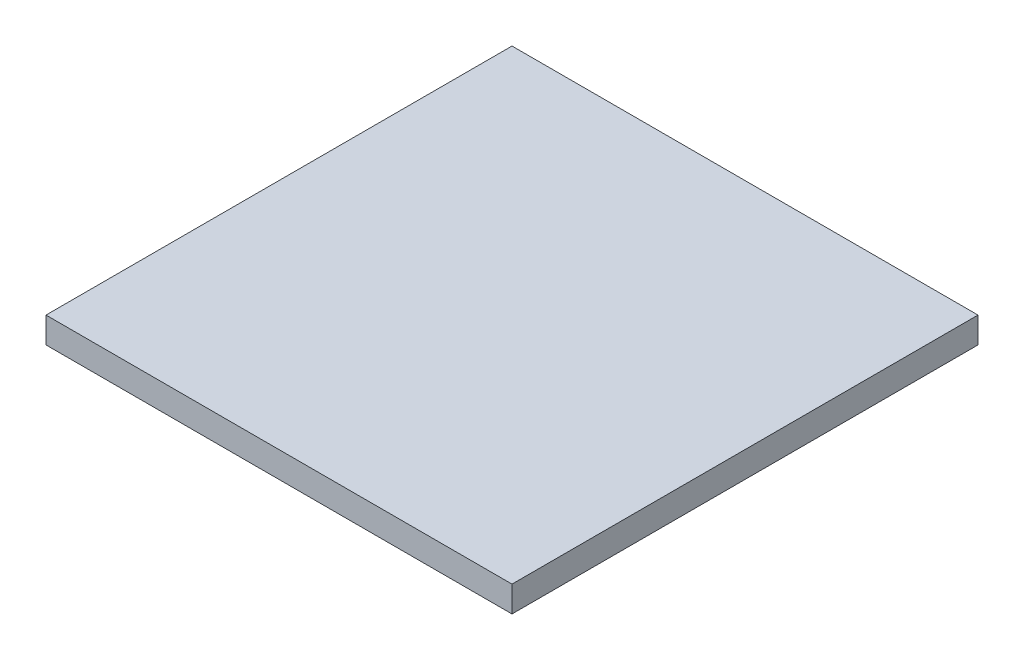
ISO-10303-21;
HEADER;
FILE_DESCRIPTION(('STEP AP214'),'2;1');
FILE_NAME('part.step','',(''),(''),'','','');
FILE_SCHEMA(('AUTOMOTIVE_DESIGN { 1 0 10303 214 1 1 1 1 }'));
ENDSEC;
DATA;
#1=APPLICATION_CONTEXT('core data for automotive mechanical design processes');
#2=APPLICATION_PROTOCOL_DEFINITION('international standard','automotive_design',2000,#1);
#3=PRODUCT_CONTEXT('',#1,'mechanical');
#4=PRODUCT('Part','Part','',(#3));
#5=PRODUCT_RELATED_PRODUCT_CATEGORY('part','',(#4));
#6=PRODUCT_DEFINITION_FORMATION('','',#4);
#7=PRODUCT_DEFINITION_CONTEXT('part definition',#1,'design');
#8=PRODUCT_DEFINITION('design','',#6,#7);
#9=PRODUCT_DEFINITION_SHAPE('','',#8);
#10=(LENGTH_UNIT() NAMED_UNIT(*) SI_UNIT(.MILLI.,.METRE.));
#11=(NAMED_UNIT(*) PLANE_ANGLE_UNIT() SI_UNIT($,.RADIAN.));
#12=(NAMED_UNIT(*) SI_UNIT($,.STERADIAN.) SOLID_ANGLE_UNIT());
#13=UNCERTAINTY_MEASURE_WITH_UNIT(LENGTH_MEASURE(1.E-05),#10,'distance_accuracy_value','');
#14=(GEOMETRIC_REPRESENTATION_CONTEXT(3) GLOBAL_UNCERTAINTY_ASSIGNED_CONTEXT((#13)) GLOBAL_UNIT_ASSIGNED_CONTEXT((#10,
#11,#12)) REPRESENTATION_CONTEXT('',''));
#15=CARTESIAN_POINT('',(0.,0.,0.));
#16=DIRECTION('',(0.,0.,1.));
#17=DIRECTION('',(1.,0.,0.));
#18=AXIS2_PLACEMENT_3D('',#15,#16,#17);
#19=CARTESIAN_POINT('',(-228.6,-25.4,228.6));
#20=DIRECTION('',(-1.,0.,0.));
#21=DIRECTION('',(0.,0.,1.));
#22=AXIS2_PLACEMENT_3D('',#19,#20,#21);
#23=PLANE('',#22);
#24=DIRECTION('',(0.,0.,1.));
#25=VECTOR('',#24,1.);
#26=CARTESIAN_POINT('',(-228.6,0.,228.6));
#27=LINE('',#26,#25);
#28=CARTESIAN_POINT('',(-228.6,0.,-228.6));
#29=VERTEX_POINT('',#28);
#30=CARTESIAN_POINT('',(-228.6,0.,228.6));
#31=VERTEX_POINT('',#30);
#32=EDGE_CURVE('E71',#29,#31,#27,.T.);
#33=ORIENTED_EDGE('',*,*,#32,.F.);
#34=DIRECTION('',(0.,1.,0.));
#35=VECTOR('',#34,1.);
#36=CARTESIAN_POINT('',(-228.6,-25.4,-228.6));
#37=LINE('',#36,#35);
#38=CARTESIAN_POINT('',(-228.6,-25.4,-228.6));
#39=VERTEX_POINT('',#38);
#40=EDGE_CURVE('E11',#39,#29,#37,.T.);
#41=ORIENTED_EDGE('',*,*,#40,.F.);
#42=DIRECTION('',(0.,0.,1.));
#43=VECTOR('',#42,1.);
#44=CARTESIAN_POINT('',(-228.6,-25.4,228.6));
#45=LINE('',#44,#43);
#46=CARTESIAN_POINT('',(-228.6,-25.4,228.6));
#47=VERTEX_POINT('',#46);
#48=EDGE_CURVE('E73',#39,#47,#45,.T.);
#49=ORIENTED_EDGE('',*,*,#48,.T.);
#50=DIRECTION('',(0.,1.,0.));
#51=VECTOR('',#50,1.);
#52=CARTESIAN_POINT('',(-228.6,-25.4,228.6));
#53=LINE('',#52,#51);
#54=EDGE_CURVE('E34',#47,#31,#53,.T.);
#55=ORIENTED_EDGE('',*,*,#54,.T.);
#56=EDGE_LOOP('',(#33,#41,#49,#55));
#57=FACE_BOUND('',#56,.T.);
#58=ADVANCED_FACE('F31',(#57),#23,.T.);
#59=CARTESIAN_POINT('',(-228.6,-25.4,-228.6));
#60=DIRECTION('',(0.,0.,-1.));
#61=DIRECTION('',(-1.,0.,0.));
#62=AXIS2_PLACEMENT_3D('',#59,#60,#61);
#63=PLANE('',#62);
#64=DIRECTION('',(-1.,0.,0.));
#65=VECTOR('',#64,1.);
#66=CARTESIAN_POINT('',(-228.6,0.,-228.6));
#67=LINE('',#66,#65);
#68=CARTESIAN_POINT('',(228.6,0.,-228.6));
#69=VERTEX_POINT('',#68);
#70=EDGE_CURVE('E88',#69,#29,#67,.T.);
#71=ORIENTED_EDGE('',*,*,#70,.F.);
#72=DIRECTION('',(0.,1.,0.));
#73=VECTOR('',#72,1.);
#74=CARTESIAN_POINT('',(228.6,-25.4,-228.6));
#75=LINE('',#74,#73);
#76=CARTESIAN_POINT('',(228.6,-25.4,-228.6));
#77=VERTEX_POINT('',#76);
#78=EDGE_CURVE('E39',#77,#69,#75,.T.);
#79=ORIENTED_EDGE('',*,*,#78,.F.);
#80=DIRECTION('',(-1.,0.,0.));
#81=VECTOR('',#80,1.);
#82=CARTESIAN_POINT('',(-228.6,-25.4,-228.6));
#83=LINE('',#82,#81);
#84=EDGE_CURVE('E78',#77,#39,#83,.T.);
#85=ORIENTED_EDGE('',*,*,#84,.T.);
#86=ORIENTED_EDGE('',*,*,#40,.T.);
#87=EDGE_LOOP('',(#71,#79,#85,#86));
#88=FACE_BOUND('',#87,.T.);
#89=ADVANCED_FACE('F103',(#88),#63,.T.);
#90=CARTESIAN_POINT('',(228.6,-25.4,228.6));
#91=DIRECTION('',(1.,0.,0.));
#92=DIRECTION('',(0.,0.,-1.));
#93=AXIS2_PLACEMENT_3D('',#90,#91,#92);
#94=PLANE('',#93);
#95=DIRECTION('',(0.,0.,-1.));
#96=VECTOR('',#95,1.);
#97=CARTESIAN_POINT('',(228.6,0.,228.6));
#98=LINE('',#97,#96);
#99=CARTESIAN_POINT('',(228.6,0.,228.6));
#100=VERTEX_POINT('',#99);
#101=EDGE_CURVE('E85',#100,#69,#98,.T.);
#102=ORIENTED_EDGE('',*,*,#101,.F.);
#103=DIRECTION('',(0.,1.,0.));
#104=VECTOR('',#103,1.);
#105=CARTESIAN_POINT('',(228.6,-25.4,228.6));
#106=LINE('',#105,#104);
#107=CARTESIAN_POINT('',(228.6,-25.4,228.6));
#108=VERTEX_POINT('',#107);
#109=EDGE_CURVE('E77',#108,#100,#106,.T.);
#110=ORIENTED_EDGE('',*,*,#109,.F.);
#111=DIRECTION('',(0.,0.,-1.));
#112=VECTOR('',#111,1.);
#113=CARTESIAN_POINT('',(228.6,-25.4,228.6));
#114=LINE('',#113,#112);
#115=EDGE_CURVE('E96',#108,#77,#114,.T.);
#116=ORIENTED_EDGE('',*,*,#115,.T.);
#117=ORIENTED_EDGE('',*,*,#78,.T.);
#118=EDGE_LOOP('',(#102,#110,#116,#117));
#119=FACE_BOUND('',#118,.T.);
#120=ADVANCED_FACE('F100',(#119),#94,.T.);
#121=CARTESIAN_POINT('',(-228.6,-25.4,228.6));
#122=DIRECTION('',(0.,0.,1.));
#123=DIRECTION('',(1.,0.,0.));
#124=AXIS2_PLACEMENT_3D('',#121,#122,#123);
#125=PLANE('',#124);
#126=DIRECTION('',(1.,0.,0.));
#127=VECTOR('',#126,1.);
#128=CARTESIAN_POINT('',(-228.6,0.,228.6));
#129=LINE('',#128,#127);
#130=EDGE_CURVE('E80',#31,#100,#129,.T.);
#131=ORIENTED_EDGE('',*,*,#130,.F.);
#132=ORIENTED_EDGE('',*,*,#54,.F.);
#133=DIRECTION('',(1.,0.,0.));
#134=VECTOR('',#133,1.);
#135=CARTESIAN_POINT('',(-228.6,-25.4,228.6));
#136=LINE('',#135,#134);
#137=EDGE_CURVE('E94',#47,#108,#136,.T.);
#138=ORIENTED_EDGE('',*,*,#137,.T.);
#139=ORIENTED_EDGE('',*,*,#109,.T.);
#140=EDGE_LOOP('',(#131,#132,#138,#139));
#141=FACE_BOUND('',#140,.T.);
#142=ADVANCED_FACE('F81',(#141),#125,.T.);
#143=CARTESIAN_POINT('',(-228.6,-25.4,-228.6));
#144=DIRECTION('',(0.,-1.,0.));
#145=DIRECTION('',(0.,0.,-1.));
#146=AXIS2_PLACEMENT_3D('',#143,#144,#145);
#147=PLANE('',#146);
#148=ORIENTED_EDGE('',*,*,#48,.F.);
#149=ORIENTED_EDGE('',*,*,#84,.F.);
#150=ORIENTED_EDGE('',*,*,#115,.F.);
#151=ORIENTED_EDGE('',*,*,#137,.F.);
#152=EDGE_LOOP('',(#148,#149,#150,#151));
#153=FACE_BOUND('',#152,.T.);
#154=ADVANCED_FACE('F105',(#153),#147,.T.);
#155=CARTESIAN_POINT('',(-228.6,0.,-228.6));
#156=DIRECTION('',(0.,-1.,0.));
#157=DIRECTION('',(0.,0.,-1.));
#158=AXIS2_PLACEMENT_3D('',#155,#156,#157);
#159=PLANE('',#158);
#160=ORIENTED_EDGE('',*,*,#32,.T.);
#161=ORIENTED_EDGE('',*,*,#130,.T.);
#162=ORIENTED_EDGE('',*,*,#101,.T.);
#163=ORIENTED_EDGE('',*,*,#70,.T.);
#164=EDGE_LOOP('',(#160,#161,#162,#163));
#165=FACE_BOUND('',#164,.T.);
#166=ADVANCED_FACE('F87',(#165),#159,.F.);
#167=CLOSED_SHELL('',(#58,#89,#120,#142,#154,#166));
#168=MANIFOLD_SOLID_BREP('B2',#167);
#169=ADVANCED_BREP_SHAPE_REPRESENTATION('',(#18,#168),#14);
#170=SHAPE_DEFINITION_REPRESENTATION(#9,#169);
ENDSEC;
END-ISO-10303-21;
